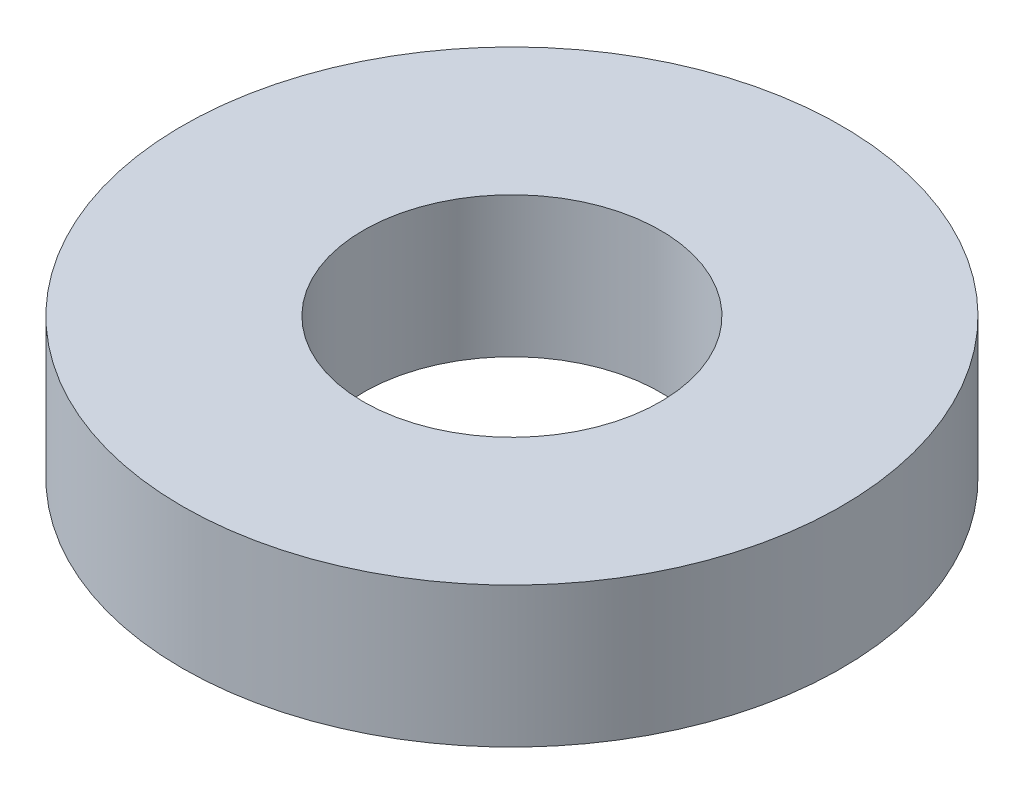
from build123d import *

# Parameters (mm, degrees)
SKETCH1_R           = 13.6
SKETCH1_R_2         = 6.13
BOSS_EXTRUDE1_DEPTH = 2.895


with BuildPart() as part:
    # Sketch1 → Boss-Extrude1 (new, symmetric)
    with BuildSketch(Plane(origin=(0, 0, 0), x_dir=(1, 0, 0), z_dir=(0, 1, 0))):
        with Locations(Location((0, 0, 0), (0, 0, 270))):
            Circle(SKETCH1_R)
        with Locations(Location((0, 0, 0), (0, 0, 270))):
            Circle(SKETCH1_R_2, mode=Mode.SUBTRACT)
    extrude(amount=BOSS_EXTRUDE1_DEPTH, both=True)


solid = part.part
